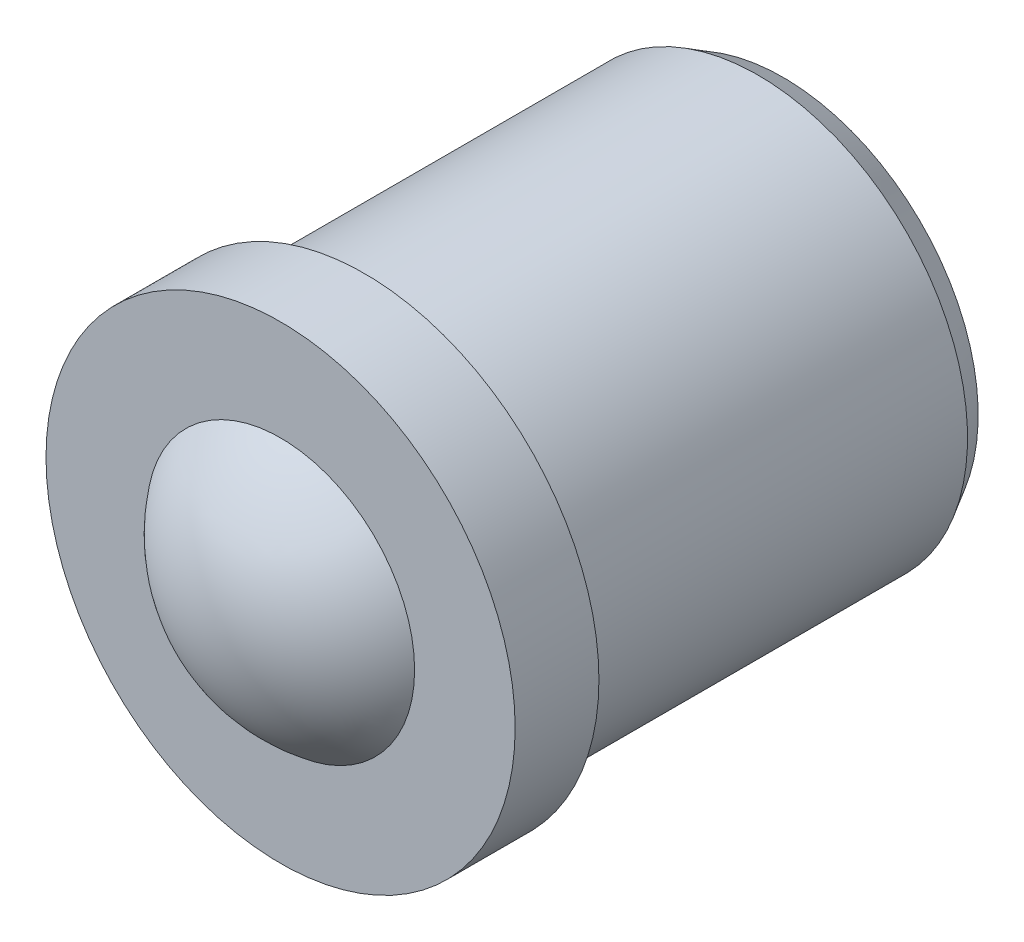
ISO-10303-21;
HEADER;
FILE_DESCRIPTION(('STEP AP214'),'2;1');
FILE_NAME('part.step','',(''),(''),'','','');
FILE_SCHEMA(('AUTOMOTIVE_DESIGN { 1 0 10303 214 1 1 1 1 }'));
ENDSEC;
DATA;
#1=APPLICATION_CONTEXT('core data for automotive mechanical design processes');
#2=APPLICATION_PROTOCOL_DEFINITION('international standard','automotive_design',2000,#1);
#3=PRODUCT_CONTEXT('',#1,'mechanical');
#4=PRODUCT('Part','Part','',(#3));
#5=PRODUCT_RELATED_PRODUCT_CATEGORY('part','',(#4));
#6=PRODUCT_DEFINITION_FORMATION('','',#4);
#7=PRODUCT_DEFINITION_CONTEXT('part definition',#1,'design');
#8=PRODUCT_DEFINITION('design','',#6,#7);
#9=PRODUCT_DEFINITION_SHAPE('','',#8);
#10=(LENGTH_UNIT() NAMED_UNIT(*) SI_UNIT(.MILLI.,.METRE.));
#11=(NAMED_UNIT(*) PLANE_ANGLE_UNIT() SI_UNIT($,.RADIAN.));
#12=(NAMED_UNIT(*) SI_UNIT($,.STERADIAN.) SOLID_ANGLE_UNIT());
#13=UNCERTAINTY_MEASURE_WITH_UNIT(LENGTH_MEASURE(1.E-05),#10,'distance_accuracy_value','');
#14=(GEOMETRIC_REPRESENTATION_CONTEXT(3) GLOBAL_UNCERTAINTY_ASSIGNED_CONTEXT((#13)) GLOBAL_UNIT_ASSIGNED_CONTEXT((#10,
#11,#12)) REPRESENTATION_CONTEXT('',''));
#15=CARTESIAN_POINT('',(0.,0.,0.));
#16=DIRECTION('',(0.,0.,1.));
#17=DIRECTION('',(1.,0.,0.));
#18=AXIS2_PLACEMENT_3D('',#15,#16,#17);
#19=CARTESIAN_POINT('',(0.,0.,-5.));
#20=DIRECTION('',(0.,0.,1.));
#21=DIRECTION('',(-1.,0.,0.));
#22=AXIS2_PLACEMENT_3D('',#19,#20,#21);
#23=PLANE('',#22);
#24=CARTESIAN_POINT('',(0.,0.,-5.));
#25=DIRECTION('',(0.,0.,1.));
#26=DIRECTION('',(-1.,0.,0.));
#27=AXIS2_PLACEMENT_3D('',#24,#25,#26);
#28=CIRCLE('',#27,2.3267949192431);
#29=CARTESIAN_POINT('',(-2.32679491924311,0.,-5.));
#30=VERTEX_POINT('',#29);
#31=EDGE_CURVE('E18',#30,#30,#28,.T.);
#32=ORIENTED_EDGE('',*,*,#31,.F.);
#33=EDGE_LOOP('',(#32));
#34=FACE_BOUND('',#33,.T.);
#35=ADVANCED_FACE('F12',(#34),#23,.F.);
#36=CARTESIAN_POINT('',(0.,0.,-5.));
#37=DIRECTION('',(0.,0.,1.));
#38=DIRECTION('',(-1.,0.,0.));
#39=AXIS2_PLACEMENT_3D('',#36,#37,#38);
#40=CONICAL_SURFACE('',#39,2.3267949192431,0.523598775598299);
#41=CARTESIAN_POINT('',(0.,0.,-4.7));
#42=DIRECTION('',(0.,0.,1.));
#43=DIRECTION('',(-1.,0.,0.));
#44=AXIS2_PLACEMENT_3D('',#41,#42,#43);
#45=CIRCLE('',#44,2.5);
#46=CARTESIAN_POINT('',(-2.5,0.,-4.7));
#47=VERTEX_POINT('',#46);
#48=EDGE_CURVE('E22',#47,#47,#45,.T.);
#49=ORIENTED_EDGE('',*,*,#48,.F.);
#50=EDGE_LOOP('',(#49));
#51=FACE_BOUND('',#50,.T.);
#52=ORIENTED_EDGE('',*,*,#31,.T.);
#53=EDGE_LOOP('',(#52));
#54=FACE_BOUND('',#53,.T.);
#55=ADVANCED_FACE('F55',(#51,#54),#40,.T.);
#56=CARTESIAN_POINT('',(0.,0.,1.));
#57=DIRECTION('',(0.,0.,1.));
#58=DIRECTION('',(-1.,0.,0.));
#59=AXIS2_PLACEMENT_3D('',#56,#57,#58);
#60=CYLINDRICAL_SURFACE('',#59,2.5);
#61=CARTESIAN_POINT('',(0.,0.,0.));
#62=DIRECTION('',(0.,0.,1.));
#63=DIRECTION('',(-1.,0.,0.));
#64=AXIS2_PLACEMENT_3D('',#61,#62,#63);
#65=CIRCLE('',#64,2.5);
#66=CARTESIAN_POINT('',(-2.5,0.,0.));
#67=VERTEX_POINT('',#66);
#68=EDGE_CURVE('E26',#67,#67,#65,.T.);
#69=ORIENTED_EDGE('',*,*,#68,.F.);
#70=EDGE_LOOP('',(#69));
#71=FACE_BOUND('',#70,.T.);
#72=ORIENTED_EDGE('',*,*,#48,.T.);
#73=EDGE_LOOP('',(#72));
#74=FACE_BOUND('',#73,.T.);
#75=ADVANCED_FACE('F49',(#71,#74),#60,.T.);
#76=CARTESIAN_POINT('',(-2.5,0.,0.));
#77=DIRECTION('',(0.,0.,1.));
#78=DIRECTION('',(-1.,0.,0.));
#79=AXIS2_PLACEMENT_3D('',#76,#77,#78);
#80=PLANE('',#79);
#81=CARTESIAN_POINT('',(0.,0.,0.));
#82=DIRECTION('',(0.,0.,1.));
#83=DIRECTION('',(-1.,0.,0.));
#84=AXIS2_PLACEMENT_3D('',#81,#82,#83);
#85=CIRCLE('',#84,2.8);
#86=CARTESIAN_POINT('',(-2.8,0.,0.));
#87=VERTEX_POINT('',#86);
#88=EDGE_CURVE('E31',#87,#87,#85,.T.);
#89=ORIENTED_EDGE('',*,*,#88,.F.);
#90=EDGE_LOOP('',(#89));
#91=FACE_BOUND('',#90,.T.);
#92=ORIENTED_EDGE('',*,*,#68,.T.);
#93=EDGE_LOOP('',(#92));
#94=FACE_BOUND('',#93,.T.);
#95=ADVANCED_FACE('F43',(#91,#94),#80,.F.);
#96=CARTESIAN_POINT('',(0.,0.,1.));
#97=DIRECTION('',(0.,0.,1.));
#98=DIRECTION('',(-1.,0.,0.));
#99=AXIS2_PLACEMENT_3D('',#96,#97,#98);
#100=CYLINDRICAL_SURFACE('',#99,2.8);
#101=CARTESIAN_POINT('',(0.,0.,1.));
#102=DIRECTION('',(0.,0.,1.));
#103=DIRECTION('',(-1.,0.,0.));
#104=AXIS2_PLACEMENT_3D('',#101,#102,#103);
#105=CIRCLE('',#104,2.8);
#106=CARTESIAN_POINT('',(-2.8,0.,1.));
#107=VERTEX_POINT('',#106);
#108=EDGE_CURVE('E34',#107,#107,#105,.T.);
#109=ORIENTED_EDGE('',*,*,#108,.F.);
#110=EDGE_LOOP('',(#109));
#111=FACE_BOUND('',#110,.T.);
#112=ORIENTED_EDGE('',*,*,#88,.T.);
#113=EDGE_LOOP('',(#112));
#114=FACE_BOUND('',#113,.T.);
#115=ADVANCED_FACE('F40',(#111,#114),#100,.T.);
#116=CARTESIAN_POINT('',(-2.8,0.,1.));
#117=DIRECTION('',(0.,0.,-1.));
#118=DIRECTION('',(1.,0.,0.));
#119=AXIS2_PLACEMENT_3D('',#116,#117,#118);
#120=PLANE('',#119);
#121=ORIENTED_EDGE('',*,*,#108,.T.);
#122=EDGE_LOOP('',(#121));
#123=FACE_BOUND('',#122,.T.);
#124=CARTESIAN_POINT('',(0.,0.,1.));
#125=DIRECTION('',(0.,0.,1.));
#126=DIRECTION('',(-1.,0.,0.));
#127=AXIS2_PLACEMENT_3D('',#124,#125,#126);
#128=CIRCLE('',#127,1.6);
#129=CARTESIAN_POINT('',(-1.6,0.,1.));
#130=VERTEX_POINT('',#129);
#131=EDGE_CURVE('E8',#130,#130,#128,.F.);
#132=ORIENTED_EDGE('',*,*,#131,.T.);
#133=EDGE_LOOP('',(#132));
#134=FACE_BOUND('',#133,.T.);
#135=ADVANCED_FACE('F38',(#123,#134),#120,.F.);
#136=CARTESIAN_POINT('',(0.,0.,-0.2));
#137=DIRECTION('',(0.,0.,-1.));
#138=DIRECTION('',(-1.,0.,0.));
#139=AXIS2_PLACEMENT_3D('',#136,#137,#138);
#140=SPHERICAL_SURFACE('',#139,2.);
#141=ORIENTED_EDGE('',*,*,#131,.F.);
#142=EDGE_LOOP('',(#141));
#143=FACE_BOUND('',#142,.T.);
#144=ADVANCED_FACE('F68',(#143),#140,.T.);
#145=CLOSED_SHELL('',(#35,#55,#75,#95,#115,#135,#144));
#146=MANIFOLD_SOLID_BREP('B1',#145);
#147=ADVANCED_BREP_SHAPE_REPRESENTATION('',(#18,#146),#14);
#148=SHAPE_DEFINITION_REPRESENTATION(#9,#147);
ENDSEC;
END-ISO-10303-21;
